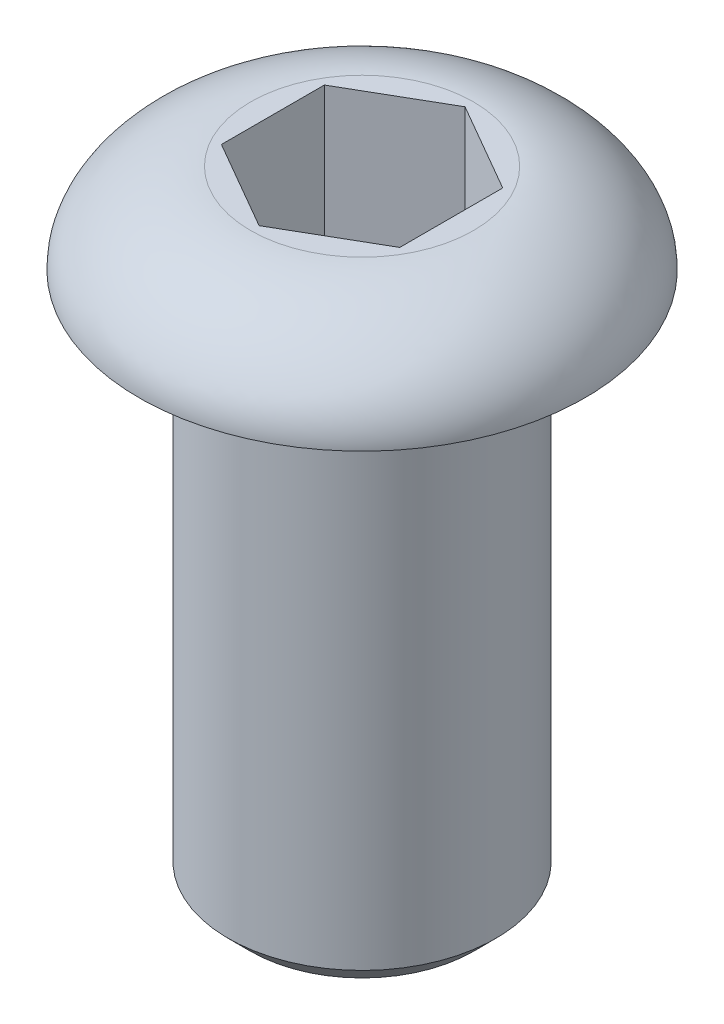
from build123d import *

# Parameters (mm, degrees)
ENL_V_MAT_EXTRU_1_DEPTH      = 14.928388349
ENL_V_MAT_EXTRU_1_DEPTH_BACK = 1


with BuildPart() as part:
    # Esquisse1 → R_volution1 (revolve)
    with BuildSketch(Plane.XY, mode=Mode.PRIVATE) as r_volution1_sk:
        with BuildLine():
            Line((0, -12), (2.5, -12))
            Line((2.5, -12), (3, -11.5))
            Line((3, -11.5), (3, 0))
            Line((3, 0), (5, 0))
            add(Edge.make_bspline(
                [(2.5, 2), (3.567187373, 2), (5, 1.067187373), (5, 0)],
                knots=[0, 0, 0, 0, 1, 1, 1, 1], degree=3))
            Line((2.5, 2), (0, 2))
            Line((0, 2), (0, -12))
        make_face()
    revolve(r_volution1_sk.sketch.rotate(Axis((0, 2, 0), (0, -1, 0)), 180), axis=Axis((0, 2, 0), (0, -1, 0)))

    # Esquisse3 → Enl_v. mat.-Extru.1 (cut, two sides: drawn at the far end of the back side and taken through both)
    with BuildSketch(Plane(origin=(0, 0, 0), x_dir=(1, 0, 0), z_dir=(0, 1, 0)).offset(-ENL_V_MAT_EXTRU_1_DEPTH_BACK)):
        Polygon((0, -2.309401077), (2, -1.154700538), (2, 1.154700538), (0, 2.309401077), (-2, 1.154700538), (-2, -1.154700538), align=None)
    extrude(amount=ENL_V_MAT_EXTRU_1_DEPTH + ENL_V_MAT_EXTRU_1_DEPTH_BACK, mode=Mode.SUBTRACT)


solid = part.part
